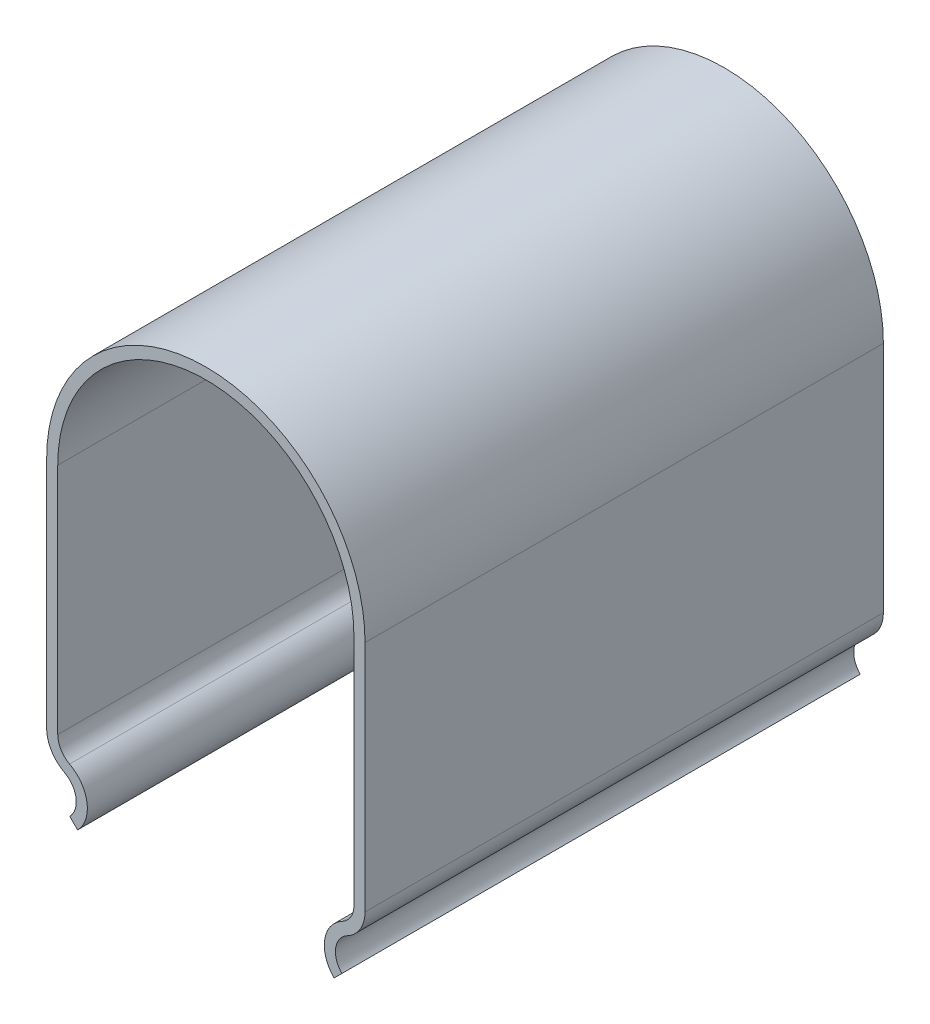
from build123d import *

# Parameters (mm, degrees)
BASE_EXTRUSION_DEPTH = 70


with BuildPart() as part:
    # Esquisse1 → Base-Extrusion (new body)
    with BuildSketch(Plane.XY):
        with BuildLine():
            Line((20, 0), (20, -31.5))
            ThreePointArc((20, -31.5), (19.569046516, -33.049193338), (18.4, -34.153299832))
            ThreePointArc((18.4, -34.153299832), (16.050489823, -37.461044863), (17.318019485, -41.315230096))
            Line((17.318019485, -41.315230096), (18.378679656, -40.254569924))
            ThreePointArc((18.378679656, -40.254569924), (17.533659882, -37.685113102), (19.1, -35.479949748))
            ThreePointArc((19.1, -35.479949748), (20.853569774, -33.823790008), (21.5, -31.5))
            Line((21.5, -31.5), (21.5, 0))
            ThreePointArc((21.5, 0), (0, 21.5), (-21.5, 0))
            Line((-21.5, 0), (-21.5, -31.5))
            ThreePointArc((-21.5, -31.5), (-20.853569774, -33.823790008), (-19.1, -35.479949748))
            ThreePointArc((-19.1, -35.479949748), (-17.533659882, -37.685113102), (-18.378679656, -40.254569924))
            Line((-18.378679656, -40.254569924), (-17.318019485, -41.315230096))
            ThreePointArc((-17.318019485, -41.315230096), (-16.050489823, -37.461044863), (-18.4, -34.153299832))
            ThreePointArc((-18.4, -34.153299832), (-19.569046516, -33.049193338), (-20, -31.5))
            Line((-20, -31.5), (-20, 0))
            ThreePointArc((-20, 0), (0, 20), (20, 0))
        make_face()
    extrude(amount=BASE_EXTRUSION_DEPTH)


solid = part.part
